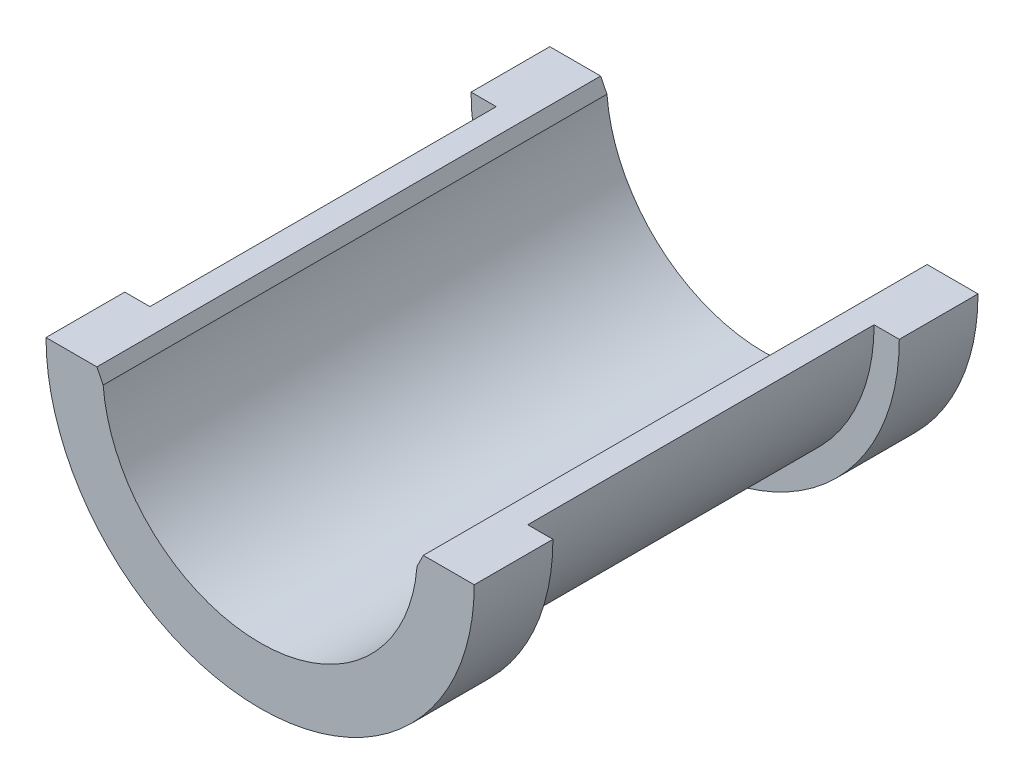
from build123d import *

# Parameters (mm, degrees)
EXTRUDE_1_DEPTH     = 40
EXTRUDE_START       = -12.5
EXTRUDE_2_DEPTH     = 12.5
EXTRUDE_3_DEPTH     = 12.5
CUT_EXTRUDE_1_DEPTH = 112.606451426


with BuildPart() as part:
    # Sketch 1 → Extrude 1 (new, symmetric)
    with BuildSketch(Plane.XY):
        with BuildLine():
            Line((-25, 70), (-30, 70))
            ThreePointArc((-30, 70), (0, 40), (30, 70))
            Line((30, 70), (25, 70))
            ThreePointArc((25, 70), (0, 45), (-25, 70))
        make_face()
    extrude(amount=EXTRUDE_1_DEPTH, both=True)

    # Sketch 2 → Extrude 2 (add)
    with BuildSketch(Plane.XY.offset(40).offset(EXTRUDE_START)):
        with BuildLine():
            Line((-25, 70), (-34, 70))
            ThreePointArc((-34, 70), (0, 36), (34, 70))
            Line((34, 70), (25, 70))
            ThreePointArc((25, 70), (0, 45), (-25, 70))
        make_face()
    extrude(amount=EXTRUDE_2_DEPTH)

    # Sketch 3 → Extrude 3 (add)
    with BuildSketch(Plane(origin=(0, 0, -40), x_dir=(-1, 0, 0), z_dir=(0, 0, -1)).offset(EXTRUDE_START)):
        with BuildLine():
            Line((-25, 70), (-34, 70))
            ThreePointArc((-34, 70), (0, 36), (34, 70))
            Line((34, 70), (25, 70))
            ThreePointArc((25, 70), (0, 45), (-25, 70))
        make_face()
    extrude(amount=EXTRUDE_3_DEPTH)

    # Sketch 4 → Cut-Extrude 1 (cut, through all)
    with BuildSketch(Plane.XY.offset(40)):
        Polygon((-25.919871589, 70), (-24.919871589, 68), (-24.919871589, 70), align=None)
    cut_extrude_1 = extrude(amount=-CUT_EXTRUDE_1_DEPTH, mode=Mode.SUBTRACT)

    # Mirror 1: Cut-Extrude 1 across plane
    add(cut_extrude_1.mirror(Plane(origin=(0, 0, 0), x_dir=(0, 0, 1), z_dir=(1, 0, 0))), mode=Mode.SUBTRACT)


solid = part.part
